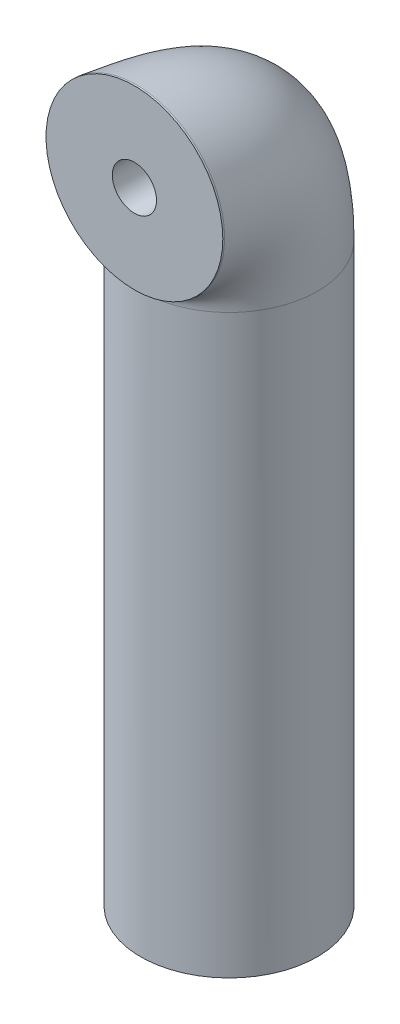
ISO-10303-21;
HEADER;
FILE_DESCRIPTION(('STEP AP214'),'2;1');
FILE_NAME('part.step','',(''),(''),'','','');
FILE_SCHEMA(('AUTOMOTIVE_DESIGN { 1 0 10303 214 1 1 1 1 }'));
ENDSEC;
DATA;
#1=APPLICATION_CONTEXT('core data for automotive mechanical design processes');
#2=APPLICATION_PROTOCOL_DEFINITION('international standard','automotive_design',2000,#1);
#3=PRODUCT_CONTEXT('',#1,'mechanical');
#4=PRODUCT('Part','Part','',(#3));
#5=PRODUCT_RELATED_PRODUCT_CATEGORY('part','',(#4));
#6=PRODUCT_DEFINITION_FORMATION('','',#4);
#7=PRODUCT_DEFINITION_CONTEXT('part definition',#1,'design');
#8=PRODUCT_DEFINITION('design','',#6,#7);
#9=PRODUCT_DEFINITION_SHAPE('','',#8);
#10=(LENGTH_UNIT() NAMED_UNIT(*) SI_UNIT(.MILLI.,.METRE.));
#11=(NAMED_UNIT(*) PLANE_ANGLE_UNIT() SI_UNIT($,.RADIAN.));
#12=(NAMED_UNIT(*) SI_UNIT($,.STERADIAN.) SOLID_ANGLE_UNIT());
#13=UNCERTAINTY_MEASURE_WITH_UNIT(LENGTH_MEASURE(1.E-05),#10,'distance_accuracy_value','');
#14=(GEOMETRIC_REPRESENTATION_CONTEXT(3) GLOBAL_UNCERTAINTY_ASSIGNED_CONTEXT((#13)) GLOBAL_UNIT_ASSIGNED_CONTEXT((#10,
#11,#12)) REPRESENTATION_CONTEXT('',''));
#15=CARTESIAN_POINT('',(0.,0.,0.));
#16=DIRECTION('',(0.,0.,1.));
#17=DIRECTION('',(1.,0.,0.));
#18=AXIS2_PLACEMENT_3D('',#15,#16,#17);
#19=CARTESIAN_POINT('',(0.,405.,-105.));
#20=DIRECTION('',(0.,-1.,0.));
#21=DIRECTION('',(0.,0.,-1.));
#22=AXIS2_PLACEMENT_3D('',#19,#20,#21);
#23=CYLINDRICAL_SURFACE('',#22,100.);
#24=CARTESIAN_POINT('',(-3.05445442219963,705.,-5.04665934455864));
#25=CARTESIAN_POINT('',(3.48747642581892,705.,-4.84674577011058));
#26=CARTESIAN_POINT('',(16.6107055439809,705.,-5.7351700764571));
#27=CARTESIAN_POINT('',(35.6569906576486,705.,-10.8833459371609));
#28=CARTESIAN_POINT('',(53.3330838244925,705.,-19.6479557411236));
#29=CARTESIAN_POINT('',(68.9596667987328,705.,-31.6928225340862));
#30=CARTESIAN_POINT('',(81.9361602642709,705.,-46.5547271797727));
#31=CARTESIAN_POINT('',(91.7638725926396,705.,-63.6627212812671));
#32=CARTESIAN_POINT('',(98.0651951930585,705.,-82.3592686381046));
#33=CARTESIAN_POINT('',(100.597859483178,705.,-101.925851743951));
#34=CARTESIAN_POINT('',(99.2646682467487,705.,-121.610562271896));
#35=CARTESIAN_POINT('',(94.1167239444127,705.,-140.656998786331));
#36=CARTESIAN_POINT('',(85.3519777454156,705.,-158.333132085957));
#37=CARTESIAN_POINT('',(73.3071662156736,705.000000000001,-173.959701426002));
#38=CARTESIAN_POINT('',(58.445222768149,705.,-186.936182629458));
#39=CARTESIAN_POINT('',(41.3372577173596,705.,-196.763892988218));
#40=CARTESIAN_POINT('',(22.640736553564,705.,-203.065179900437));
#41=CARTESIAN_POINT('',(3.07415014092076,705.,-205.597859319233));
#42=CARTESIAN_POINT('',(-16.6105731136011,705.,-204.26465293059));
#43=CARTESIAN_POINT('',(-35.6569679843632,705.,-199.116744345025));
#44=CARTESIAN_POINT('',(-53.333096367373,705.000000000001,-190.351994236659));
#45=CARTESIAN_POINT('',(-68.9596598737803,705.,-178.30720530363));
#46=CARTESIAN_POINT('',(-81.9361639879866,705.,-163.445257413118));
#47=CARTESIAN_POINT('',(-91.7638707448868,705.,-146.33728721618));
#48=CARTESIAN_POINT('',(-98.0651958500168,705.,-127.640726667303));
#49=CARTESIAN_POINT('',(-100.59785936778,705.000000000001,-108.074152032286));
#50=CARTESIAN_POINT('',(-99.264667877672,704.999999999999,-88.3894330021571));
#51=CARTESIAN_POINT('',(-94.1167252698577,705.,-69.3430098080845));
#52=CARTESIAN_POINT('',(-85.3519749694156,705.,-51.6668523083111));
#53=CARTESIAN_POINT('',(-73.3071714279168,705.,-36.0403267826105));
#54=CARTESIAN_POINT('',(-58.4452133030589,705.,-23.0637666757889));
#55=CARTESIAN_POINT('',(-41.3372748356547,705.,-13.23619850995));
#56=CARTESIAN_POINT('',(-22.6408795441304,705.,-6.93465152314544));
#57=CARTESIAN_POINT('',(-9.59638527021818,705.,-5.2465729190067));
#58=CARTESIAN_POINT('',(-3.05445442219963,705.,-5.04665934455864));
#59=B_SPLINE_CURVE_WITH_KNOTS('',3,(#24,#25,#26,#27,#28,#29,#30,#31,#32,#33,#34,#35,#36,#37,#38,
#39,#40,#41,#42,#43,#44,#45,#46,#47,#48,#49,#50,#51,#52,#53,#54,#55,#56,#57,#58),.UNSPECIFIED.,
.T.,.F.,(4,1,1,1,1,1,1,1,1,1,1,1,1,1,1,1,1,1,1,1,1,1,1,1,1,1,1,1,1,1,1,1,4),(0.,0.03125,0.0625,
0.09375,0.125,0.15625,0.1875,0.21875,0.25,0.28125,0.3125,0.34375,0.375,0.40625,0.4375,0.46875,
0.5,0.53125,0.5625,0.59375,0.625,0.65625,0.6875,0.71875,0.75,0.78125,0.8125,0.84375,0.875,
0.90625,0.9375,0.96875,1.),.UNSPECIFIED.);
#60=CARTESIAN_POINT('',(-3.05445442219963,705.,-5.04665934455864));
#61=VERTEX_POINT('',#60);
#62=EDGE_CURVE('E101',#61,#61,#59,.T.);
#63=ORIENTED_EDGE('',*,*,#62,.F.);
#64=EDGE_LOOP('',(#63));
#65=FACE_BOUND('',#64,.T.);
#66=CARTESIAN_POINT('',(0.,53.,-105.));
#67=DIRECTION('',(0.,-1.,0.));
#68=DIRECTION('',(0.,0.,-1.));
#69=AXIS2_PLACEMENT_3D('',#66,#67,#68);
#70=CIRCLE('',#69,100.);
#71=CARTESIAN_POINT('',(0.,53.,-205.));
#72=VERTEX_POINT('',#71);
#73=EDGE_CURVE('E97',#72,#72,#70,.T.);
#74=ORIENTED_EDGE('',*,*,#73,.F.);
#75=EDGE_LOOP('',(#74));
#76=FACE_BOUND('',#75,.T.);
#77=ADVANCED_FACE('F68',(#65,#76),#23,.T.);
#78=CARTESIAN_POINT('',(0.,810.,2.));
#79=DIRECTION('',(0.,0.,-1.));
#80=DIRECTION('',(-1.,0.,0.));
#81=AXIS2_PLACEMENT_3D('',#78,#79,#80);
#82=CYLINDRICAL_SURFACE('',#81,100.);
#83=CARTESIAN_POINT('',(0.,810.,2.));
#84=DIRECTION('',(0.,0.,-1.));
#85=DIRECTION('',(1.,0.,0.));
#86=AXIS2_PLACEMENT_3D('',#83,#84,#85);
#87=CIRCLE('',#86,100.);
#88=CARTESIAN_POINT('',(100.,810.,2.));
#89=VERTEX_POINT('',#88);
#90=EDGE_CURVE('E79',#89,#89,#87,.T.);
#91=ORIENTED_EDGE('',*,*,#90,.T.);
#92=EDGE_LOOP('',(#91));
#93=FACE_BOUND('',#92,.T.);
#94=CARTESIAN_POINT('',(0.59528390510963,710.001771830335,0.));
#95=CARTESIAN_POINT('',(-5.94958482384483,709.962810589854,0.));
#96=CARTESIAN_POINT('',(-19.0469946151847,711.17371809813,0.));
#97=CARTESIAN_POINT('',(-37.9609047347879,716.788759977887,0.));
#98=CARTESIAN_POINT('',(-55.4160949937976,725.985443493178,0.));
#99=CARTESIAN_POINT('',(-70.7417205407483,738.410986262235,0.));
#100=CARTESIAN_POINT('',(-83.348776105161,753.587538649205,0.));
#101=CARTESIAN_POINT('',(-92.7527627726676,770.932060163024,0.));
#102=CARTESIAN_POINT('',(-98.592357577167,789.777926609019,0.));
#103=CARTESIAN_POINT('',(-100.643036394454,809.400879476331,0.));
#104=CARTESIAN_POINT('',(-98.8261237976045,829.046847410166,0.));
#105=CARTESIAN_POINT('',(-93.2113096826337,847.960914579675,0.));
#106=CARTESIAN_POINT('',(-84.0144888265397,865.416141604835,0.));
#107=CARTESIAN_POINT('',(-71.5890016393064,880.741754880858,0.));
#108=CARTESIAN_POINT('',(-56.4124107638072,893.348797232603,0.));
#109=CARTESIAN_POINT('',(-39.0679183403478,902.752782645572,0.));
#110=CARTESIAN_POINT('',(-20.2220789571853,908.592342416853,0.));
#111=CARTESIAN_POINT('',(-0.599122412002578,910.643036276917,0.));
#112=CARTESIAN_POINT('',(19.0468578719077,908.826108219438,0.));
#113=CARTESIAN_POINT('',(37.9608842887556,903.211330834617,0.));
#114=CARTESIAN_POINT('',(55.4161063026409,894.014506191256,0.));
#115=CARTESIAN_POINT('',(70.7417143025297,881.589041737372,0.));
#116=CARTESIAN_POINT('',(83.348779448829,866.412445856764,0.));
#117=CARTESIAN_POINT('',(92.7527611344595,849.067948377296,0.));
#118=CARTESIAN_POINT('',(98.5923581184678,830.222068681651,0.));
#119=CARTESIAN_POINT('',(100.643036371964,810.599124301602,0.));
#120=CARTESIAN_POINT('',(98.8261233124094,790.953147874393,0.));
#121=CARTESIAN_POINT('',(93.2113112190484,772.039093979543,0.));
#122=CARTESIAN_POINT('',(84.014485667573,754.583842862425,0.));
#123=CARTESIAN_POINT('',(71.5890075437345,739.258273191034,0.));
#124=CARTESIAN_POINT('',(56.4124000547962,726.65115232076,0.));
#125=CARTESIAN_POINT('',(39.0679377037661,717.247308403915,0.));
#126=CARTESIAN_POINT('',(20.2222177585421,711.407485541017,0.));
#127=CARTESIAN_POINT('',(7.14015263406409,710.040733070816,0.));
#128=CARTESIAN_POINT('',(0.59528390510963,710.001771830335,0.));
#129=B_SPLINE_CURVE_WITH_KNOTS('',3,(#94,#95,#96,#97,#98,#99,#100,#101,#102,#103,#104,#105,#106,
#107,#108,#109,#110,#111,#112,#113,#114,#115,#116,#117,#118,#119,#120,#121,#122,#123,#124,#125,
#126,#127,#128),.UNSPECIFIED.,.T.,.F.,(4,1,1,1,1,1,1,1,1,1,1,1,1,1,1,1,1,1,1,1,1,1,1,1,1,1,1,1,
1,1,1,1,4),(0.,0.03125,0.0625,0.09375,0.125,0.15625,0.1875,0.21875,0.25,0.28125,0.3125,0.34375,
0.375,0.40625,0.4375,0.46875,0.5,0.53125,0.5625,0.59375,0.625,0.65625,0.6875,0.71875,0.75,
0.78125,0.8125,0.84375,0.875,0.90625,0.9375,0.96875,1.),.UNSPECIFIED.);
#130=CARTESIAN_POINT('',(0.59528390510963,710.001771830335,0.));
#131=VERTEX_POINT('',#130);
#132=EDGE_CURVE('E85',#131,#131,#129,.F.);
#133=ORIENTED_EDGE('',*,*,#132,.T.);
#134=EDGE_LOOP('',(#133));
#135=FACE_BOUND('',#134,.T.);
#136=ADVANCED_FACE('F157',(#93,#135),#82,.T.);
#137=CARTESIAN_POINT('',(0.,810.,2.));
#138=DIRECTION('',(0.,0.,1.));
#139=DIRECTION('',(1.,0.,0.));
#140=AXIS2_PLACEMENT_3D('',#137,#138,#139);
#141=PLANE('',#140);
#142=CARTESIAN_POINT('',(0.,810.,2.));
#143=DIRECTION('',(0.,0.,1.));
#144=DIRECTION('',(1.,0.,0.));
#145=AXIS2_PLACEMENT_3D('',#142,#143,#144);
#146=CIRCLE('',#145,25.);
#147=CARTESIAN_POINT('',(25.,810.,2.));
#148=VERTEX_POINT('',#147);
#149=EDGE_CURVE('E106',#148,#148,#146,.T.);
#150=ORIENTED_EDGE('',*,*,#149,.F.);
#151=EDGE_LOOP('',(#150));
#152=FACE_BOUND('',#151,.T.);
#153=ORIENTED_EDGE('',*,*,#90,.F.);
#154=EDGE_LOOP('',(#153));
#155=FACE_BOUND('',#154,.T.);
#156=ADVANCED_FACE('F139',(#152,#155),#141,.T.);
#157=CARTESIAN_POINT('',(0.595283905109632,710.001771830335,0.));
#158=CARTESIAN_POINT('',(-1.229585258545,709.765375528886,-2.52332967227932));
#159=CARTESIAN_POINT('',(-3.05445442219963,709.528979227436,-5.04665934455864));
#160=CARTESIAN_POINT('',(-3.05445442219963,705.,-5.04665934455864));
#161=CARTESIAN_POINT('',(7.1401526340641,710.040733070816,0.));
#162=CARTESIAN_POINT('',(5.31381452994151,709.769308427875,-2.42337288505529));
#163=CARTESIAN_POINT('',(3.48747642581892,709.497883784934,-4.84674577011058));
#164=CARTESIAN_POINT('',(3.48747642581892,705.,-4.84674577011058));
#165=CARTESIAN_POINT('',(20.2222177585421,711.407485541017,0.));
#166=CARTESIAN_POINT('',(18.4164616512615,710.908898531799,-2.86758503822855));
#167=CARTESIAN_POINT('',(16.6107055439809,710.410311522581,-5.7351700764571));
#168=CARTESIAN_POINT('',(16.6107055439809,705.,-5.7351700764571));
#169=CARTESIAN_POINT('',(39.0679377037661,717.247308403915,0.));
#170=CARTESIAN_POINT('',(37.3624641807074,716.092569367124,-5.44167296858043));
#171=CARTESIAN_POINT('',(35.6569906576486,714.937830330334,-10.8833459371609));
#172=CARTESIAN_POINT('',(35.6569906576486,705.,-10.8833459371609));
#173=CARTESIAN_POINT('',(56.4124000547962,726.65115232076,0.));
#174=CARTESIAN_POINT('',(54.8727419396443,724.588371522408,-9.8239778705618));
#175=CARTESIAN_POINT('',(53.3330838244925,722.525590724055,-19.6479557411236));
#176=CARTESIAN_POINT('',(53.3330838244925,705.,-19.6479557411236));
#177=CARTESIAN_POINT('',(71.5890075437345,739.258273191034,0.));
#178=CARTESIAN_POINT('',(70.2743371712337,736.043805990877,-15.8464112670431));
#179=CARTESIAN_POINT('',(68.9596667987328,732.82933879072,-31.6928225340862));
#180=CARTESIAN_POINT('',(68.9596667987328,705.,-31.6928225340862));
#181=CARTESIAN_POINT('',(84.014485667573,754.583842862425,0.));
#182=CARTESIAN_POINT('',(82.9753229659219,750.011402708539,-23.2773635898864));
#183=CARTESIAN_POINT('',(81.9361602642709,745.438962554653,-46.5547271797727));
#184=CARTESIAN_POINT('',(81.9361602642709,705.,-46.5547271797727));
#185=CARTESIAN_POINT('',(93.2113112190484,772.039093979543,0.));
#186=CARTESIAN_POINT('',(92.487591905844,765.950085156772,-31.8313606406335));
#187=CARTESIAN_POINT('',(91.7638725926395,759.861076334,-63.6627212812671));
#188=CARTESIAN_POINT('',(91.7638725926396,705.,-63.6627212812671));
#189=CARTESIAN_POINT('',(98.8261233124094,790.953147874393,0.));
#190=CARTESIAN_POINT('',(98.445659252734,783.245606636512,-41.1796343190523));
#191=CARTESIAN_POINT('',(98.0651951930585,775.538065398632,-82.3592686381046));
#192=CARTESIAN_POINT('',(98.0651951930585,705.,-82.3592686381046));
#193=CARTESIAN_POINT('',(100.643036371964,810.599124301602,0.));
#194=CARTESIAN_POINT('',(100.620447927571,801.232337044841,-50.9629258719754));
#195=CARTESIAN_POINT('',(100.597859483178,791.865549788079,-101.925851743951));
#196=CARTESIAN_POINT('',(100.597859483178,705.,-101.925851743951));
#197=CARTESIAN_POINT('',(98.5923581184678,830.222068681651,0.));
#198=CARTESIAN_POINT('',(98.9285131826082,819.218597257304,-60.8052811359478));
#199=CARTESIAN_POINT('',(99.2646682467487,808.215125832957,-121.610562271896));
#200=CARTESIAN_POINT('',(99.2646682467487,705.,-121.610562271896));
#201=CARTESIAN_POINT('',(92.7527611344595,849.067948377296,0.));
#202=CARTESIAN_POINT('',(93.4347425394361,836.512955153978,-70.3284993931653));
#203=CARTESIAN_POINT('',(94.1167239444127,823.95796193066,-140.656998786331));
#204=CARTESIAN_POINT('',(94.1167239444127,705.,-140.656998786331));
#205=CARTESIAN_POINT('',(83.348779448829,866.412445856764,0.));
#206=CARTESIAN_POINT('',(84.3503785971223,852.450547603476,-79.1665660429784));
#207=CARTESIAN_POINT('',(85.3519777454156,838.488649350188,-158.333132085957));
#208=CARTESIAN_POINT('',(85.3519777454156,705.,-158.333132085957));
#209=CARTESIAN_POINT('',(70.7417143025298,881.589041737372,0.));
#210=CARTESIAN_POINT('',(72.0244402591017,866.418807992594,-86.9798507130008));
#211=CARTESIAN_POINT('',(73.3071662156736,851.248574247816,-173.959701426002));
#212=CARTESIAN_POINT('',(73.3071662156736,705.,-173.959701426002));
#213=CARTESIAN_POINT('',(55.4161063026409,894.014506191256,0.));
#214=CARTESIAN_POINT('',(56.930664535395,877.880868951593,-93.4680913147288));
#215=CARTESIAN_POINT('',(58.445222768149,861.74723171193,-186.936182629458));
#216=CARTESIAN_POINT('',(58.445222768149,705.,-186.936182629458));
#217=CARTESIAN_POINT('',(37.9608842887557,903.211330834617,0.));
#218=CARTESIAN_POINT('',(39.6490710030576,886.396198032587,-98.3819464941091));
#219=CARTESIAN_POINT('',(41.3372577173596,869.581065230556,-196.763892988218));
#220=CARTESIAN_POINT('',(41.3372577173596,705.,-196.763892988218));
#221=CARTESIAN_POINT('',(19.0468578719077,908.826108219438,0.));
#222=CARTESIAN_POINT('',(20.8437972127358,891.637545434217,-101.532589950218));
#223=CARTESIAN_POINT('',(22.640736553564,874.448982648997,-203.065179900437));
#224=CARTESIAN_POINT('',(22.640736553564,705.,-203.065179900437));
#225=CARTESIAN_POINT('',(-0.599122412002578,910.643036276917,0.));
#226=CARTESIAN_POINT('',(1.23751386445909,893.403445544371,-102.798929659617));
#227=CARTESIAN_POINT('',(3.07415014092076,876.163854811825,-205.597859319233));
#228=CARTESIAN_POINT('',(3.07415014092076,705.,-205.597859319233));
#229=CARTESIAN_POINT('',(-20.2220789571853,908.592342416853,0.));
#230=CARTESIAN_POINT('',(-18.4163260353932,891.626076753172,-102.132326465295));
#231=CARTESIAN_POINT('',(-16.6105731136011,874.659811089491,-204.26465293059));
#232=CARTESIAN_POINT('',(-16.6105731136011,705.,-204.26465293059));
#233=CARTESIAN_POINT('',(-39.0679183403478,902.752782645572,0.));
#234=CARTESIAN_POINT('',(-37.3624431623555,886.373700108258,-99.5583721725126));
#235=CARTESIAN_POINT('',(-35.6569679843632,869.994617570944,-199.116744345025));
#236=CARTESIAN_POINT('',(-35.6569679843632,705.,-199.116744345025));
#237=CARTESIAN_POINT('',(-56.4124107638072,893.348797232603,0.));
#238=CARTESIAN_POINT('',(-54.8727535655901,877.848203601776,-95.1759971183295));
#239=CARTESIAN_POINT('',(-53.333096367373,862.347609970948,-190.351994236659));
#240=CARTESIAN_POINT('',(-53.333096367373,705.,-190.351994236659));
#241=CARTESIAN_POINT('',(-71.5890016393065,880.741754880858,0.));
#242=CARTESIAN_POINT('',(-70.2743307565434,866.377225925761,-89.1536026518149));
#243=CARTESIAN_POINT('',(-68.9596598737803,852.012696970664,-178.30720530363));
#244=CARTESIAN_POINT('',(-68.9596598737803,705.,-178.30720530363));
#245=CARTESIAN_POINT('',(-84.0144888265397,865.416141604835,0.));
#246=CARTESIAN_POINT('',(-82.9753264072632,852.401639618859,-81.7226287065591));
#247=CARTESIAN_POINT('',(-81.9361639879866,839.387137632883,-163.445257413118));
#248=CARTESIAN_POINT('',(-81.9361639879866,705.,-163.445257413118));
#249=CARTESIAN_POINT('',(-93.2113096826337,847.960914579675,0.));
#250=CARTESIAN_POINT('',(-92.4875902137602,836.458589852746,-73.1686436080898));
#251=CARTESIAN_POINT('',(-91.7638707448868,824.956265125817,-146.33728721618));
#252=CARTESIAN_POINT('',(-91.7638707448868,705.,-146.33728721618));
#253=CARTESIAN_POINT('',(-98.8261237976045,829.046847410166,0.));
#254=CARTESIAN_POINT('',(-98.4456598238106,819.16084683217,-63.8203633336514));
#255=CARTESIAN_POINT('',(-98.0651958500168,809.274846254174,-127.640726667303));
#256=CARTESIAN_POINT('',(-98.0651958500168,705.,-127.640726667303));
#257=CARTESIAN_POINT('',(-100.643036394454,809.400879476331,0.));
#258=CARTESIAN_POINT('',(-100.620447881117,801.173394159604,-54.0370760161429));
#259=CARTESIAN_POINT('',(-100.59785936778,792.945908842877,-108.074152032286));
#260=CARTESIAN_POINT('',(-100.59785936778,705.000000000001,-108.074152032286));
#261=CARTESIAN_POINT('',(-98.592357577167,789.777926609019,0.));
#262=CARTESIAN_POINT('',(-98.9285127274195,783.187690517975,-44.1947165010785));
#263=CARTESIAN_POINT('',(-99.264667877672,776.597454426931,-88.3894330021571));
#264=CARTESIAN_POINT('',(-99.264667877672,704.999999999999,-88.3894330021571));
#265=CARTESIAN_POINT('',(-92.7527627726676,770.932060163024,0.));
#266=CARTESIAN_POINT('',(-93.4347440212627,765.895346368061,-34.6715049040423));
#267=CARTESIAN_POINT('',(-94.1167252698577,760.858632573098,-69.3430098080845));
#268=CARTESIAN_POINT('',(-94.1167252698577,705.,-69.3430098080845));
#269=CARTESIAN_POINT('',(-83.348776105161,753.587538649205,0.));
#270=CARTESIAN_POINT('',(-84.3503755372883,749.961781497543,-25.8334261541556));
#271=CARTESIAN_POINT('',(-85.3519749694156,746.33602434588,-51.6668523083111));
#272=CARTESIAN_POINT('',(-85.3519749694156,705.,-51.6668523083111));
#273=CARTESIAN_POINT('',(-70.7417205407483,738.410986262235,0.));
#274=CARTESIAN_POINT('',(-72.0244459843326,736.000956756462,-18.0201633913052));
#275=CARTESIAN_POINT('',(-73.3071714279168,733.590927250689,-36.0403267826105));
#276=CARTESIAN_POINT('',(-73.3071714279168,705.,-36.0403267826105));
#277=CARTESIAN_POINT('',(-55.4160949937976,725.985443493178,0.));
#278=CARTESIAN_POINT('',(-56.9306541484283,724.553060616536,-11.5318833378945));
#279=CARTESIAN_POINT('',(-58.4452133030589,723.120677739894,-23.0637666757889));
#280=CARTESIAN_POINT('',(-58.4452133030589,705.,-23.0637666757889));
#281=CARTESIAN_POINT('',(-37.9609047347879,716.788759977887,0.));
#282=CARTESIAN_POINT('',(-39.6490897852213,716.065299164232,-6.61809925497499));
#283=CARTESIAN_POINT('',(-41.3372748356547,715.341838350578,-13.23619850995));
#284=CARTESIAN_POINT('',(-41.3372748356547,705.,-13.23619850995));
#285=CARTESIAN_POINT('',(-19.0469946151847,711.17371809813,0.));
#286=CARTESIAN_POINT('',(-20.8439370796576,710.885301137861,-3.46732576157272));
#287=CARTESIAN_POINT('',(-22.6408795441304,710.596884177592,-6.93465152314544));
#288=CARTESIAN_POINT('',(-22.6408795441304,705.,-6.93465152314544));
#289=CARTESIAN_POINT('',(-5.94958482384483,709.962810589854,0.));
#290=CARTESIAN_POINT('',(-7.77298504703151,709.761442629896,-2.62328645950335));
#291=CARTESIAN_POINT('',(-9.59638527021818,709.560074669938,-5.2465729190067));
#292=CARTESIAN_POINT('',(-9.59638527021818,705.,-5.2465729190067));
#293=CARTESIAN_POINT('',(0.595283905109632,710.001771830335,0.));
#294=CARTESIAN_POINT('',(-1.229585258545,709.765375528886,-2.52332967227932));
#295=CARTESIAN_POINT('',(-3.05445442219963,709.528979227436,-5.04665934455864));
#296=CARTESIAN_POINT('',(-3.05445442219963,705.,-5.04665934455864));
#297=B_SPLINE_SURFACE_WITH_KNOTS('',3,3,((#157,#158,#159,#160),(#161,#162,#163,#164),(#165,#166,
#167,#168),(#169,#170,#171,#172),(#173,#174,#175,#176),(#177,#178,#179,#180),(#181,#182,#183,
#184),(#185,#186,#187,#188),(#189,#190,#191,#192),(#193,#194,#195,#196),(#197,#198,#199,#200),
(#201,#202,#203,#204),(#205,#206,#207,#208),(#209,#210,#211,#212),(#213,#214,#215,#216),(#217,
#218,#219,#220),(#221,#222,#223,#224),(#225,#226,#227,#228),(#229,#230,#231,#232),(#233,#234,
#235,#236),(#237,#238,#239,#240),(#241,#242,#243,#244),(#245,#246,#247,#248),(#249,#250,#251,
#252),(#253,#254,#255,#256),(#257,#258,#259,#260),(#261,#262,#263,#264),(#265,#266,#267,#268),
(#269,#270,#271,#272),(#273,#274,#275,#276),(#277,#278,#279,#280),(#281,#282,#283,#284),(#285,
#286,#287,#288),(#289,#290,#291,#292),(#293,#294,#295,#296)),.UNSPECIFIED.,.T.,.F.,.F.,(4,1,1,1,
1,1,1,1,1,1,1,1,1,1,1,1,1,1,1,1,1,1,1,1,1,1,1,1,1,1,1,1,4),(4,4),(0.,0.03125,0.0625,0.09375,
0.125,0.15625,0.1875,0.21875,0.25,0.28125,0.3125,0.34375,0.375,0.40625,0.4375,0.46875,0.5,
0.53125,0.5625,0.59375,0.625,0.65625,0.6875,0.71875,0.75,0.78125,0.8125,0.84375,0.875,0.90625,
0.9375,0.96875,1.),(0.,1.),.UNSPECIFIED.);
#298=ORIENTED_EDGE('',*,*,#132,.F.);
#299=EDGE_LOOP('',(#298));
#300=FACE_BOUND('',#299,.T.);
#301=ORIENTED_EDGE('',*,*,#62,.T.);
#302=EDGE_LOOP('',(#301));
#303=FACE_BOUND('',#302,.T.);
#304=ADVANCED_FACE('F126',(#300,#303),#297,.F.);
#305=CARTESIAN_POINT('',(0.,810.,-48.));
#306=DIRECTION('',(0.,0.,1.));
#307=DIRECTION('',(1.,0.,0.));
#308=AXIS2_PLACEMENT_3D('',#305,#306,#307);
#309=CYLINDRICAL_SURFACE('',#308,25.);
#310=ORIENTED_EDGE('',*,*,#149,.T.);
#311=EDGE_LOOP('',(#310));
#312=FACE_BOUND('',#311,.T.);
#313=CARTESIAN_POINT('',(0.,810.,-48.));
#314=DIRECTION('',(0.,0.,1.));
#315=DIRECTION('',(1.,0.,0.));
#316=AXIS2_PLACEMENT_3D('',#313,#314,#315);
#317=CIRCLE('',#316,25.);
#318=CARTESIAN_POINT('',(25.,810.,-48.));
#319=VERTEX_POINT('',#318);
#320=EDGE_CURVE('E96',#319,#319,#317,.T.);
#321=ORIENTED_EDGE('',*,*,#320,.F.);
#322=EDGE_LOOP('',(#321));
#323=FACE_BOUND('',#322,.T.);
#324=ADVANCED_FACE('F138',(#312,#323),#309,.F.);
#325=CARTESIAN_POINT('',(0.,810.,-48.));
#326=DIRECTION('',(0.,0.,1.));
#327=DIRECTION('',(1.,0.,0.));
#328=AXIS2_PLACEMENT_3D('',#325,#326,#327);
#329=PLANE('',#328);
#330=ORIENTED_EDGE('',*,*,#320,.T.);
#331=EDGE_LOOP('',(#330));
#332=FACE_BOUND('',#331,.T.);
#333=ADVANCED_FACE('F188',(#332),#329,.T.);
#334=CARTESIAN_POINT('',(0.,53.,-105.));
#335=DIRECTION('',(0.,-1.,0.));
#336=DIRECTION('',(0.,0.,-1.));
#337=AXIS2_PLACEMENT_3D('',#334,#335,#336);
#338=PLANE('',#337);
#339=CARTESIAN_POINT('',(0.,53.,-105.));
#340=DIRECTION('',(0.,-1.,0.));
#341=DIRECTION('',(0.,0.,-1.));
#342=AXIS2_PLACEMENT_3D('',#339,#340,#341);
#343=CIRCLE('',#342,25.);
#344=CARTESIAN_POINT('',(0.,53.,-130.));
#345=VERTEX_POINT('',#344);
#346=EDGE_CURVE('E276',#345,#345,#343,.T.);
#347=ORIENTED_EDGE('',*,*,#346,.F.);
#348=EDGE_LOOP('',(#347));
#349=FACE_BOUND('',#348,.T.);
#350=ORIENTED_EDGE('',*,*,#73,.T.);
#351=EDGE_LOOP('',(#350));
#352=FACE_BOUND('',#351,.T.);
#353=ADVANCED_FACE('F194',(#349,#352),#338,.T.);
#354=CARTESIAN_POINT('',(0.,103.,-105.));
#355=DIRECTION('',(0.,-1.,0.));
#356=DIRECTION('',(0.,0.,-1.));
#357=AXIS2_PLACEMENT_3D('',#354,#355,#356);
#358=CYLINDRICAL_SURFACE('',#357,25.);
#359=CARTESIAN_POINT('',(0.,103.,-105.));
#360=DIRECTION('',(0.,-1.,0.));
#361=DIRECTION('',(0.,0.,-1.));
#362=AXIS2_PLACEMENT_3D('',#359,#360,#361);
#363=CIRCLE('',#362,25.);
#364=CARTESIAN_POINT('',(0.,103.,-130.));
#365=VERTEX_POINT('',#364);
#366=EDGE_CURVE('E274',#365,#365,#363,.T.);
#367=ORIENTED_EDGE('',*,*,#366,.F.);
#368=EDGE_LOOP('',(#367));
#369=FACE_BOUND('',#368,.T.);
#370=ORIENTED_EDGE('',*,*,#346,.T.);
#371=EDGE_LOOP('',(#370));
#372=FACE_BOUND('',#371,.T.);
#373=ADVANCED_FACE('F214',(#369,#372),#358,.F.);
#374=CARTESIAN_POINT('',(0.,103.,-105.));
#375=DIRECTION('',(0.,-1.,0.));
#376=DIRECTION('',(0.,0.,-1.));
#377=AXIS2_PLACEMENT_3D('',#374,#375,#376);
#378=PLANE('',#377);
#379=ORIENTED_EDGE('',*,*,#366,.T.);
#380=EDGE_LOOP('',(#379));
#381=FACE_BOUND('',#380,.T.);
#382=ADVANCED_FACE('F222',(#381),#378,.T.);
#383=CLOSED_SHELL('',(#77,#136,#156,#304,#324,#333,#353,#373,#382));
#384=CARTESIAN_POINT('',(0.,705.,-105.));
#385=DIRECTION('',(0.,-1.,0.));
#386=DIRECTION('',(0.,0.,1.));
#387=AXIS2_PLACEMENT_3D('',#384,#385,#386);
#388=PLANE('',#387);
#389=CARTESIAN_POINT('',(0.,705.,-105.));
#390=DIRECTION('',(0.,1.,0.));
#391=DIRECTION('',(0.,0.,1.));
#392=AXIS2_PLACEMENT_3D('',#389,#390,#391);
#393=CIRCLE('',#392,98.);
#394=CARTESIAN_POINT('',(0.,705.,-6.99999999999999));
#395=VERTEX_POINT('',#394);
#396=EDGE_CURVE('E11',#395,#395,#393,.F.);
#397=ORIENTED_EDGE('',*,*,#396,.T.);
#398=EDGE_LOOP('',(#397));
#399=FACE_BOUND('',#398,.T.);
#400=ADVANCED_FACE('F141',(#399),#388,.T.);
#401=CARTESIAN_POINT('',(0.,405.,-105.));
#402=DIRECTION('',(0.,-1.,0.));
#403=DIRECTION('',(0.,0.,-1.));
#404=AXIS2_PLACEMENT_3D('',#401,#402,#403);
#405=CYLINDRICAL_SURFACE('',#404,98.);
#406=CARTESIAN_POINT('',(0.,105.,-105.));
#407=DIRECTION('',(0.,1.,0.));
#408=DIRECTION('',(0.,0.,1.));
#409=AXIS2_PLACEMENT_3D('',#406,#407,#408);
#410=CIRCLE('',#409,98.);
#411=CARTESIAN_POINT('',(0.,105.,-6.99999999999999));
#412=VERTEX_POINT('',#411);
#413=EDGE_CURVE('E93',#412,#412,#410,.F.);
#414=ORIENTED_EDGE('',*,*,#413,.T.);
#415=EDGE_LOOP('',(#414));
#416=FACE_BOUND('',#415,.T.);
#417=ORIENTED_EDGE('',*,*,#396,.F.);
#418=EDGE_LOOP('',(#417));
#419=FACE_BOUND('',#418,.T.);
#420=ADVANCED_FACE('F166',(#416,#419),#405,.F.);
#421=CARTESIAN_POINT('',(0.,105.,-105.));
#422=DIRECTION('',(0.,-1.,0.));
#423=DIRECTION('',(0.,0.,-1.));
#424=AXIS2_PLACEMENT_3D('',#421,#422,#423);
#425=PLANE('',#424);
#426=ORIENTED_EDGE('',*,*,#413,.F.);
#427=EDGE_LOOP('',(#426));
#428=FACE_BOUND('',#427,.T.);
#429=ADVANCED_FACE('F168',(#428),#425,.F.);
#430=CLOSED_SHELL('',(#400,#420,#429));
#431=ORIENTED_CLOSED_SHELL('',*,#430,.T.);
#432=BREP_WITH_VOIDS('B2',#383,(#431));
#433=ADVANCED_BREP_SHAPE_REPRESENTATION('',(#18,#432),#14);
#434=SHAPE_DEFINITION_REPRESENTATION(#9,#433);
ENDSEC;
END-ISO-10303-21;
